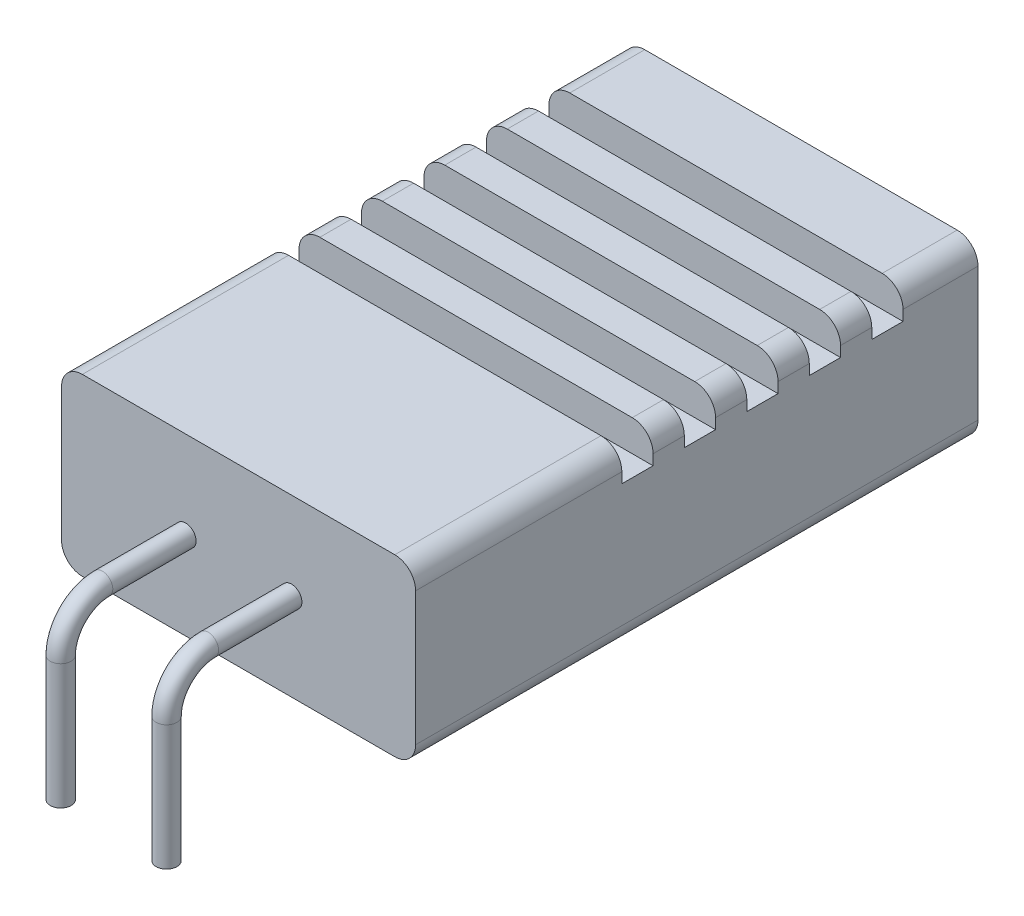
from build123d import *

# Parameters (mm, degrees)
ESQUISSE1_W             = 8.5
ESQUISSE1_H             = 13.5
EXTRUSION1_DEPTH        = 4.2
ESQUISSE2_W             = 0.75
ESQUISSE2_H             = 0.75
ENL_V_MAT_EXTRU_1_DEPTH = 17.49666633
CONG_1_R                = 0.5
ESQUISSE3_R             = 0.25


with BuildPart() as part:
    # Esquisse1 → Extrusion1 (new body)
    with BuildSketch(Plane(origin=(0, 0, 0), x_dir=(1, 0, 0), z_dir=(0, 1, 0))):
        with Locations((4.25, 6.75)):
            Rectangle(ESQUISSE1_W, ESQUISSE1_H)
    extrude(amount=EXTRUSION1_DEPTH)

    # Esquisse2 → Enl_v. mat.-Extru.1 (cut, through all)
    with BuildSketch(Plane.ZY):
        with Locations((-9.825, 3.825)):
            Rectangle(ESQUISSE2_W, ESQUISSE2_H)
        with Locations((-11.325, 3.825)):
            Rectangle(ESQUISSE2_W, ESQUISSE2_H)
        with Locations((-8.325, 3.825)):
            Rectangle(ESQUISSE2_W, ESQUISSE2_H)
        with Locations((-6.825, 3.825)):
            Rectangle(ESQUISSE2_W, ESQUISSE2_H)
        with Locations((-5.325, 3.825)):
            Rectangle(ESQUISSE2_W, ESQUISSE2_H)
    extrude(amount=-ENL_V_MAT_EXTRU_1_DEPTH, mode=Mode.SUBTRACT)

    # Cong_1
    cong_1_edges = [part.edges().sort_by_distance(p)[0] for p in [
        (8.5, 4.2, -2.475),
        (0, 4.2, -10.575),
        (8.5, 4.2, -12.6),
        (8.5, 4.2, -10.575),
        (0, 4.2, -9.075),
        (0, 4.2, -12.6),
        (8.5, 4.2, -9.075),
        (0, 4.2, -7.575),
        (8.5, 0, -6.75),
        (8.5, 4.2, -7.575),
        (0, 4.2, -6.075),
        (0, 0, -6.75),
        (8.5, 4.2, -6.075),
        (0, 4.2, -2.475),
    ]]
    fillet(cong_1_edges, radius=CONG_1_R)

    # Balayage1: sweep along a path in Esquisse4
    with BuildLine(Plane(origin=(1.71, 0, 0), x_dir=(0, 0, -1), z_dir=(1, 0, 0))) as balayage1_path:
        Line((0, 2.1), (-2, 2.1))
        ThreePointArc((-2, 2.1), (-2.707106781, 1.807106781), (-3, 1.1))
        Line((-3, 1.1), (-3, -1.9))
    # Esquisse3 → Balayage1 (sweep)
    with BuildSketch(Plane.XY):
        with Locations((5.52, 2.1)):
            Circle(ESQUISSE3_R)
        with Locations((2.98, 2.1)):
            Circle(ESQUISSE3_R)
    sweep(path=balayage1_path.line)


solid = part.part
